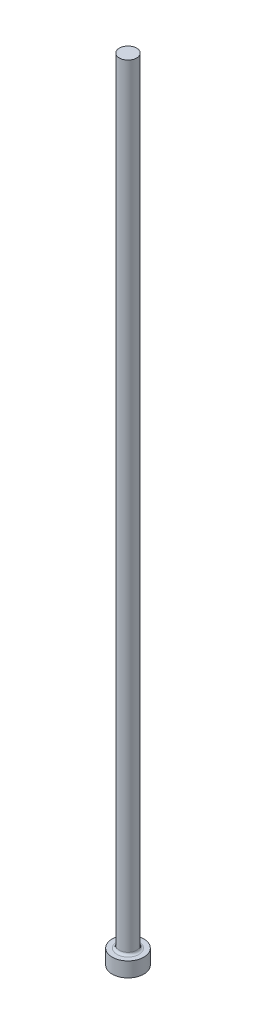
from build123d import *


with BuildPart() as part:
    # Sketch1 → Revolve1 (revolve)
    with BuildSketch(Plane.XY, mode=Mode.PRIVATE) as revolve1_sk:
        with BuildLine():
            Line((0, 0), (5.08, 0))
            Line((5.08, 0), (5.08, 4.7498))
            Line((5.08, 4.7498), (3.53949, 4.7498))
            ThreePointArc((3.53949, 4.7498), (3.000674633, 4.972984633), (2.77749, 5.5118))
            Line((2.77749, 5.5118), (2.77749, 254))
            Line((2.77749, 254), (0, 254))
            Line((0, 254), (0, 0))
        make_face()
    revolve(revolve1_sk.sketch.rotate(Axis((0, 254, 0), (0, -1, 0)), 180), axis=Axis((0, 254, 0), (0, -1, 0)))


solid = part.part
